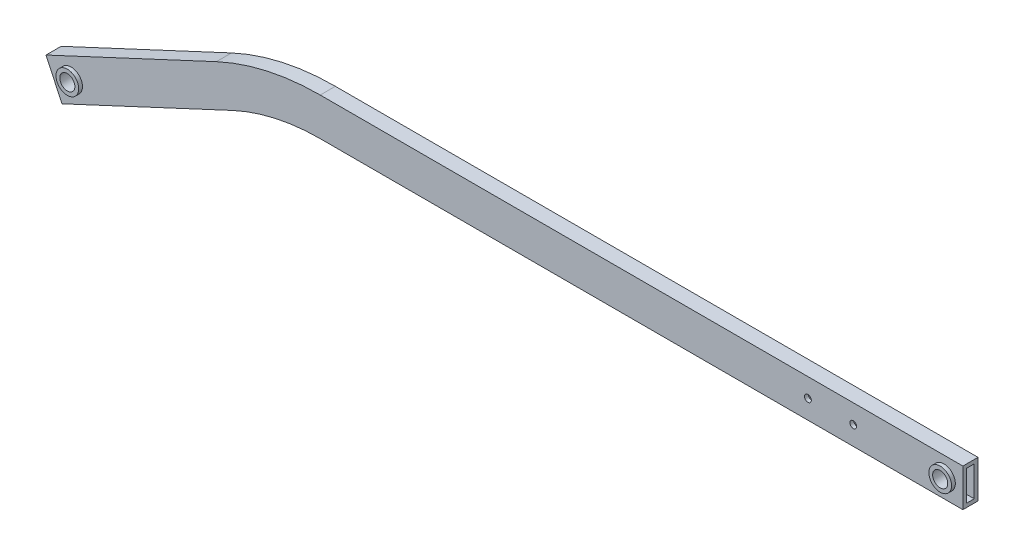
from build123d import *

# Parameters (mm, degrees)
ESQUISSE3_W             = 20
ESQUISSE3_H             = 50
ESQUISSE3_W_2           = 10
ESQUISSE3_H_2           = 40
ESQUISSE4_R             = 15
ENL_V_MAT_EXTRU_1_DEPTH = 1223.852984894
EXTRUSION1_DEPTH        = 5
EXTRUSION1_DEPTH_BACK   = 25
ESQUISSE5_R             = 15
ESQUISSE5_R_2           = 10
EXTRUSION2_DEPTH        = 5
EXTRUSION2_DEPTH_BACK   = 25
ESQUISSE6_R             = 15
ESQUISSE6_R_2           = 10
ESQUISSE7_R             = 4.5
ENL_V_MAT_EXTRU_2_DEPTH = 1223.94497941


with BuildPart() as part:
    # Balayage1: sweep along a path in Esquisse1
    with BuildLine(Plane.XY) as balayage1_path:
        Line((0, 0), (-850, 0))
        ThreePointArc((-850, 0), (-914.931884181, -7.111197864), (-976.785478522, -28.107663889))
        Line((-976.785478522, -28.107663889), (-1202.15, -133.196866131))
    # Esquisse3 → Balayage1 (sweep)
    with BuildSketch(Plane(origin=(0, 0, 0), x_dir=(0, 0, -1), z_dir=(1, 0, 0))):
        Rectangle(ESQUISSE3_W, ESQUISSE3_H)
        Rectangle(ESQUISSE3_W_2, ESQUISSE3_H_2, mode=Mode.SUBTRACT)
    sweep(path=balayage1_path.line)

    # Esquisse4 → Enl_v. mat.-Extru.1 (cut, through all)
    with BuildSketch(Plane.XY.offset(10)):
        with Locations((-1179.492305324, -122.631409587)):
            Circle(ESQUISSE4_R)
        with Locations((-25, 0)):
            Circle(ESQUISSE4_R)
    extrude(amount=-ENL_V_MAT_EXTRU_1_DEPTH, mode=Mode.SUBTRACT)

    # Esquisse5 → Extrusion1 (add, two sides: drawn at the far end of the back side and taken through both)
    with BuildSketch(Plane.XY.offset(10).offset(-EXTRUSION1_DEPTH_BACK)):
        with Locations(Location((-25, 0, 0), (0, 0, 90))):
            Circle(ESQUISSE5_R)
        with Locations((-25, 0)):
            Circle(ESQUISSE5_R_2, mode=Mode.SUBTRACT)
    extrude(amount=EXTRUSION1_DEPTH + EXTRUSION1_DEPTH_BACK)

    # Esquisse6 → Extrusion2 (add, two sides: drawn at the far end of the back side and taken through both)
    with BuildSketch(Plane.XY.offset(10).offset(-EXTRUSION2_DEPTH_BACK)):
        with Locations(Location((-1179.492305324, -122.631409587, 0), (0, 0, 90))):
            Circle(ESQUISSE6_R)
        with Locations((-1179.492305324, -122.631409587)):
            Circle(ESQUISSE6_R_2, mode=Mode.SUBTRACT)
    extrude(amount=EXTRUSION2_DEPTH + EXTRUSION2_DEPTH_BACK)

    # Esquisse7 → Enl_v. mat.-Extru.2 (cut, through all)
    with BuildSketch(Plane(origin=(0, 0, -10), x_dir=(-1, 0, 0), z_dir=(0, 0, -1))):
        with Locations(Location((145, 0, 0), (0, 0, 90))):
            Circle(ESQUISSE7_R)
        with Locations(Location((205, 0, 0), (0, 0, 90))):
            Circle(ESQUISSE7_R)
    extrude(amount=-ENL_V_MAT_EXTRU_2_DEPTH, mode=Mode.SUBTRACT)


solid = part.part
